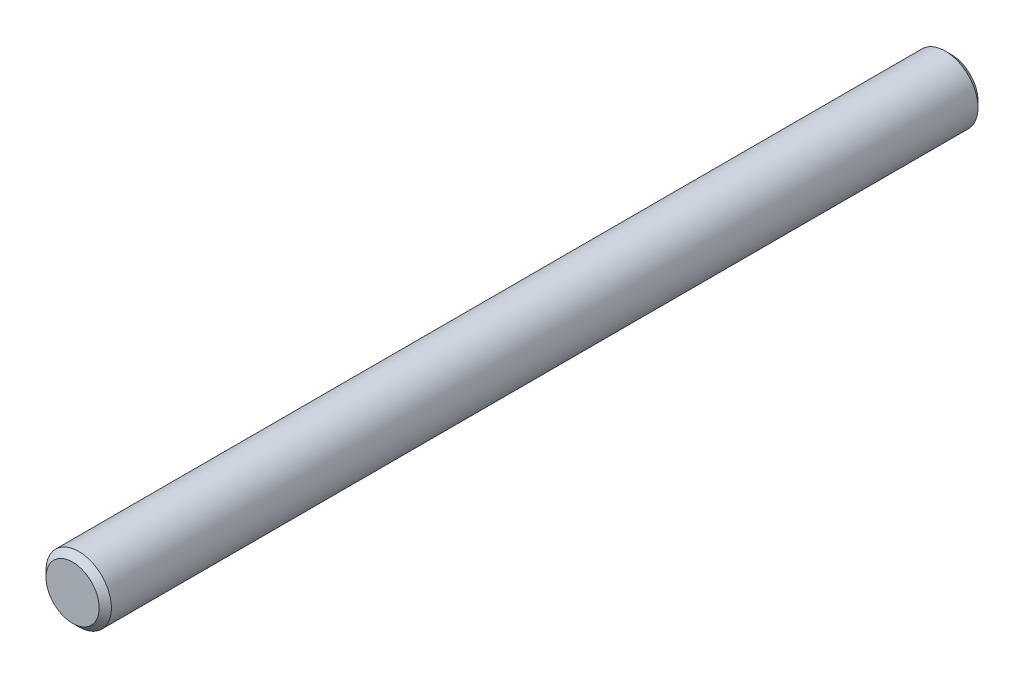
ISO-10303-21;
HEADER;
FILE_DESCRIPTION(('STEP AP214'),'2;1');
FILE_NAME('part.step','',(''),(''),'','','');
FILE_SCHEMA(('AUTOMOTIVE_DESIGN { 1 0 10303 214 1 1 1 1 }'));
ENDSEC;
DATA;
#1=APPLICATION_CONTEXT('core data for automotive mechanical design processes');
#2=APPLICATION_PROTOCOL_DEFINITION('international standard','automotive_design',2000,#1);
#3=PRODUCT_CONTEXT('',#1,'mechanical');
#4=PRODUCT('Part','Part','',(#3));
#5=PRODUCT_RELATED_PRODUCT_CATEGORY('part','',(#4));
#6=PRODUCT_DEFINITION_FORMATION('','',#4);
#7=PRODUCT_DEFINITION_CONTEXT('part definition',#1,'design');
#8=PRODUCT_DEFINITION('design','',#6,#7);
#9=PRODUCT_DEFINITION_SHAPE('','',#8);
#10=(LENGTH_UNIT() NAMED_UNIT(*) SI_UNIT(.MILLI.,.METRE.));
#11=(NAMED_UNIT(*) PLANE_ANGLE_UNIT() SI_UNIT($,.RADIAN.));
#12=(NAMED_UNIT(*) SI_UNIT($,.STERADIAN.) SOLID_ANGLE_UNIT());
#13=UNCERTAINTY_MEASURE_WITH_UNIT(LENGTH_MEASURE(1.E-05),#10,'distance_accuracy_value','');
#14=(GEOMETRIC_REPRESENTATION_CONTEXT(3) GLOBAL_UNCERTAINTY_ASSIGNED_CONTEXT((#13)) GLOBAL_UNIT_ASSIGNED_CONTEXT((#10,
#11,#12)) REPRESENTATION_CONTEXT('',''));
#15=CARTESIAN_POINT('',(0.,0.,0.));
#16=DIRECTION('',(0.,0.,1.));
#17=DIRECTION('',(1.,0.,0.));
#18=AXIS2_PLACEMENT_3D('',#15,#16,#17);
#19=CARTESIAN_POINT('',(0.,0.,215.));
#20=DIRECTION('',(0.,0.,-1.));
#21=DIRECTION('',(-1.,0.,0.));
#22=AXIS2_PLACEMENT_3D('',#19,#20,#21);
#23=CYLINDRICAL_SURFACE('',#22,8.);
#24=CARTESIAN_POINT('',(0.,0.,1.50000000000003));
#25=DIRECTION('',(0.,0.,1.));
#26=DIRECTION('',(1.,0.,0.));
#27=AXIS2_PLACEMENT_3D('',#24,#25,#26);
#28=CIRCLE('',#27,8.);
#29=CARTESIAN_POINT('',(8.,0.,1.50000000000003));
#30=VERTEX_POINT('',#29);
#31=EDGE_CURVE('E41',#30,#30,#28,.T.);
#32=ORIENTED_EDGE('',*,*,#31,.T.);
#33=EDGE_LOOP('',(#32));
#34=FACE_BOUND('',#33,.T.);
#35=CARTESIAN_POINT('',(0.,0.,213.5));
#36=DIRECTION('',(0.,0.,1.));
#37=DIRECTION('',(1.,0.,0.));
#38=AXIS2_PLACEMENT_3D('',#35,#36,#37);
#39=CIRCLE('',#38,8.);
#40=CARTESIAN_POINT('',(8.,0.,213.5));
#41=VERTEX_POINT('',#40);
#42=EDGE_CURVE('E45',#41,#41,#39,.F.);
#43=ORIENTED_EDGE('',*,*,#42,.T.);
#44=EDGE_LOOP('',(#43));
#45=FACE_BOUND('',#44,.T.);
#46=ADVANCED_FACE('F30',(#34,#45),#23,.T.);
#47=CARTESIAN_POINT('',(0.,0.,215.));
#48=DIRECTION('',(0.,0.,1.));
#49=DIRECTION('',(1.,0.,0.));
#50=AXIS2_PLACEMENT_3D('',#47,#48,#49);
#51=PLANE('',#50);
#52=CARTESIAN_POINT('',(0.,0.,215.));
#53=DIRECTION('',(0.,0.,1.));
#54=DIRECTION('',(1.,0.,0.));
#55=AXIS2_PLACEMENT_3D('',#52,#53,#54);
#56=CIRCLE('',#55,6.50000000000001);
#57=CARTESIAN_POINT('',(6.50000000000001,0.,215.));
#58=VERTEX_POINT('',#57);
#59=EDGE_CURVE('E10',#58,#58,#56,.T.);
#60=ORIENTED_EDGE('',*,*,#59,.T.);
#61=EDGE_LOOP('',(#60));
#62=FACE_BOUND('',#61,.T.);
#63=ADVANCED_FACE('F61',(#62),#51,.T.);
#64=CARTESIAN_POINT('',(0.,0.,0.));
#65=DIRECTION('',(0.,0.,1.));
#66=DIRECTION('',(1.,0.,0.));
#67=AXIS2_PLACEMENT_3D('',#64,#65,#66);
#68=PLANE('',#67);
#69=CARTESIAN_POINT('',(0.,0.,0.));
#70=DIRECTION('',(0.,0.,1.));
#71=DIRECTION('',(1.,0.,0.));
#72=AXIS2_PLACEMENT_3D('',#69,#70,#71);
#73=CIRCLE('',#72,6.49999999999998);
#74=CARTESIAN_POINT('',(6.49999999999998,0.,0.));
#75=VERTEX_POINT('',#74);
#76=EDGE_CURVE('E37',#75,#75,#73,.F.);
#77=ORIENTED_EDGE('',*,*,#76,.T.);
#78=EDGE_LOOP('',(#77));
#79=FACE_BOUND('',#78,.T.);
#80=ADVANCED_FACE('F58',(#79),#68,.F.);
#81=CARTESIAN_POINT('',(0.,0.,1.50000000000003));
#82=DIRECTION('',(0.,0.,1.));
#83=DIRECTION('',(1.,0.,0.));
#84=AXIS2_PLACEMENT_3D('',#81,#82,#83);
#85=CONICAL_SURFACE('',#84,8.,0.785398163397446);
#86=ORIENTED_EDGE('',*,*,#76,.F.);
#87=EDGE_LOOP('',(#86));
#88=FACE_BOUND('',#87,.T.);
#89=ORIENTED_EDGE('',*,*,#31,.F.);
#90=EDGE_LOOP('',(#89));
#91=FACE_BOUND('',#90,.T.);
#92=ADVANCED_FACE('F54',(#88,#91),#85,.T.);
#93=CARTESIAN_POINT('',(0.,0.,215.));
#94=DIRECTION('',(0.,0.,-1.));
#95=DIRECTION('',(-1.,0.,0.));
#96=AXIS2_PLACEMENT_3D('',#93,#94,#95);
#97=CONICAL_SURFACE('',#96,6.50000000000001,0.785398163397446);
#98=ORIENTED_EDGE('',*,*,#42,.F.);
#99=EDGE_LOOP('',(#98));
#100=FACE_BOUND('',#99,.T.);
#101=ORIENTED_EDGE('',*,*,#59,.F.);
#102=EDGE_LOOP('',(#101));
#103=FACE_BOUND('',#102,.T.);
#104=ADVANCED_FACE('F32',(#100,#103),#97,.T.);
#105=CLOSED_SHELL('',(#46,#63,#80,#92,#104));
#106=MANIFOLD_SOLID_BREP('B2',#105);
#107=ADVANCED_BREP_SHAPE_REPRESENTATION('',(#18,#106),#14);
#108=SHAPE_DEFINITION_REPRESENTATION(#9,#107);
ENDSEC;
END-ISO-10303-21;
